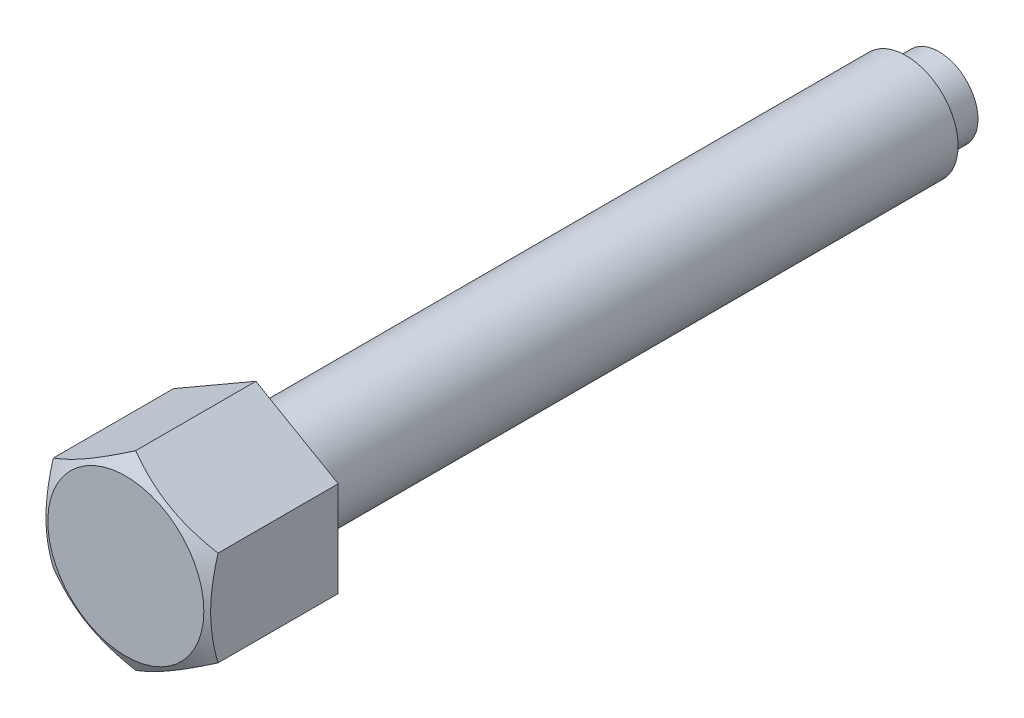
ISO-10303-21;
HEADER;
FILE_DESCRIPTION(('STEP AP214'),'2;1');
FILE_NAME('part.step','',(''),(''),'','','');
FILE_SCHEMA(('AUTOMOTIVE_DESIGN { 1 0 10303 214 1 1 1 1 }'));
ENDSEC;
DATA;
#1=APPLICATION_CONTEXT('core data for automotive mechanical design processes');
#2=APPLICATION_PROTOCOL_DEFINITION('international standard','automotive_design',2000,#1);
#3=PRODUCT_CONTEXT('',#1,'mechanical');
#4=PRODUCT('Part','Part','',(#3));
#5=PRODUCT_RELATED_PRODUCT_CATEGORY('part','',(#4));
#6=PRODUCT_DEFINITION_FORMATION('','',#4);
#7=PRODUCT_DEFINITION_CONTEXT('part definition',#1,'design');
#8=PRODUCT_DEFINITION('design','',#6,#7);
#9=PRODUCT_DEFINITION_SHAPE('','',#8);
#10=(LENGTH_UNIT() NAMED_UNIT(*) SI_UNIT(.MILLI.,.METRE.));
#11=(NAMED_UNIT(*) PLANE_ANGLE_UNIT() SI_UNIT($,.RADIAN.));
#12=(NAMED_UNIT(*) SI_UNIT($,.STERADIAN.) SOLID_ANGLE_UNIT());
#13=UNCERTAINTY_MEASURE_WITH_UNIT(LENGTH_MEASURE(1.E-05),#10,'distance_accuracy_value','');
#14=(GEOMETRIC_REPRESENTATION_CONTEXT(3) GLOBAL_UNCERTAINTY_ASSIGNED_CONTEXT((#13)) GLOBAL_UNIT_ASSIGNED_CONTEXT((#10,
#11,#12)) REPRESENTATION_CONTEXT('',''));
#15=CARTESIAN_POINT('',(0.,0.,0.));
#16=DIRECTION('',(0.,0.,1.));
#17=DIRECTION('',(1.,0.,0.));
#18=AXIS2_PLACEMENT_3D('',#15,#16,#17);
#19=CARTESIAN_POINT('',(0.,10.9696551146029,80.));
#20=DIRECTION('',(-0.5,-0.86602540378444,0.));
#21=DIRECTION('',(0.86602540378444,-0.5,0.));
#22=AXIS2_PLACEMENT_3D('',#19,#20,#21);
#23=PLANE('',#22);
#24=CARTESIAN_POINT('',(9.5002,5.4847120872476,93.862752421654));
#25=CARTESIAN_POINT('',(9.29136922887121,5.60528058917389,93.9323514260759));
#26=CARTESIAN_POINT('',(9.0817598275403,5.72629863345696,93.9987915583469));
#27=CARTESIAN_POINT('',(8.66086011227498,5.96930519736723,94.1244775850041));
#28=CARTESIAN_POINT('',(8.44956926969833,6.09129402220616,94.1837211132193));
#29=CARTESIAN_POINT('',(7.81229220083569,6.45922610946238,94.3495102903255));
#30=CARTESIAN_POINT('',(7.38379023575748,6.70662183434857,94.4438104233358));
#31=CARTESIAN_POINT('',(6.74255666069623,7.07683821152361,94.5543861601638));
#32=CARTESIAN_POINT('',(6.53174078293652,7.19855281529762,94.5858850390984));
#33=CARTESIAN_POINT('',(6.10913296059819,7.4425455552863,94.6387066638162));
#34=CARTESIAN_POINT('',(5.89734099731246,7.56482370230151,94.6600292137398));
#35=CARTESIAN_POINT('',(5.47340378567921,7.80958396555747,94.6919518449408));
#36=CARTESIAN_POINT('',(5.26125925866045,7.93206566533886,94.7025646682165));
#37=CARTESIAN_POINT('',(4.83677424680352,8.17714220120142,94.7128423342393));
#38=CARTESIAN_POINT('',(4.62443376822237,8.2997370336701,94.7125075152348));
#39=CARTESIAN_POINT('',(4.22745800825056,8.52893109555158,94.7016514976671));
#40=CARTESIAN_POINT('',(4.04279470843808,8.63554650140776,94.6924545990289));
#41=CARTESIAN_POINT('',(3.67389999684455,8.84852796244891,94.6659594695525));
#42=CARTESIAN_POINT('',(3.48966861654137,8.95489399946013,94.6486606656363));
#43=CARTESIAN_POINT('',(2.93768832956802,9.27357996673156,94.5850203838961));
#44=CARTESIAN_POINT('',(2.57091646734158,9.48533580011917,94.5269429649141));
#45=CARTESIAN_POINT('',(1.83348217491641,9.9110936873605,94.3817488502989));
#46=CARTESIAN_POINT('',(1.46291385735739,10.1250414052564,94.2940166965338));
#47=CARTESIAN_POINT('',(0.727303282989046,10.5497463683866,94.0949011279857));
#48=CARTESIAN_POINT('',(0.362251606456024,10.7605090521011,93.9835644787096));
#49=CARTESIAN_POINT('',(-0.000199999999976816,10.9697705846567,93.8627524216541));
#50=B_SPLINE_CURVE_WITH_KNOTS('',3,(#24,#25,#26,#27,#28,#29,#30,#31,#32,#33,#34,#35,#36,#37,#38,
#39,#40,#41,#42,#43,#44,#45,#46,#47,#48,#49),.UNSPECIFIED.,.F.,.F.,(4,2,2,2,2,2,2,2,2,2,2,2,4),
(0.,0.752880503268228,1.50600787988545,3.0154687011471,3.75167336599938,4.48789219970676,
5.22323407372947,5.95855322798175,6.5986808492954,7.23885375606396,8.52010929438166,
9.82978009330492,11.1368800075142),.UNSPECIFIED.);
#51=CARTESIAN_POINT('',(9.5,5.48482755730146,93.8628190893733));
#52=VERTEX_POINT('',#51);
#53=CARTESIAN_POINT('',(0.,10.9696551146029,93.8628190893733));
#54=VERTEX_POINT('',#53);
#55=EDGE_CURVE('E30',#52,#54,#50,.T.);
#56=ORIENTED_EDGE('',*,*,#55,.F.);
#57=DIRECTION('',(0.,0.,1.));
#58=VECTOR('',#57,1.);
#59=CARTESIAN_POINT('',(9.5,5.48482755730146,80.));
#60=LINE('',#59,#58);
#61=CARTESIAN_POINT('',(9.5,5.48482755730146,80.));
#62=VERTEX_POINT('',#61);
#63=EDGE_CURVE('E100',#62,#52,#60,.T.);
#64=ORIENTED_EDGE('',*,*,#63,.F.);
#65=DIRECTION('',(0.86602540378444,-0.5,0.));
#66=VECTOR('',#65,1.);
#67=CARTESIAN_POINT('',(0.,10.9696551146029,80.));
#68=LINE('',#67,#66);
#69=CARTESIAN_POINT('',(0.,10.9696551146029,80.));
#70=VERTEX_POINT('',#69);
#71=EDGE_CURVE('E38',#70,#62,#68,.T.);
#72=ORIENTED_EDGE('',*,*,#71,.F.);
#73=DIRECTION('',(0.,0.,1.));
#74=VECTOR('',#73,1.);
#75=CARTESIAN_POINT('',(0.,10.9696551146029,80.));
#76=LINE('',#75,#74);
#77=EDGE_CURVE('E88',#70,#54,#76,.T.);
#78=ORIENTED_EDGE('',*,*,#77,.T.);
#79=EDGE_LOOP('',(#56,#64,#72,#78));
#80=FACE_BOUND('',#79,.T.);
#81=ADVANCED_FACE('F15',(#80),#23,.F.);
#82=CARTESIAN_POINT('',(9.5,5.48482755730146,80.));
#83=DIRECTION('',(-1.,0.,0.));
#84=DIRECTION('',(0.,0.,1.));
#85=AXIS2_PLACEMENT_3D('',#82,#83,#84);
#86=PLANE('',#85);
#87=CARTESIAN_POINT('',(9.5,-14.6594165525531,90.1107092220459));
#88=CARTESIAN_POINT('',(9.5,-14.4522624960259,90.2110748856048));
#89=CARTESIAN_POINT('',(9.5,-14.2448633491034,90.3109344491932));
#90=CARTESIAN_POINT('',(9.5,-13.8295237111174,90.509526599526));
#91=CARTESIAN_POINT('',(9.5,-13.6215832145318,90.6082591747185));
#92=CARTESIAN_POINT('',(9.5,-12.9968165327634,90.9026207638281));
#93=CARTESIAN_POINT('',(9.5,-12.5791075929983,91.0963833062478));
#94=CARTESIAN_POINT('',(9.5,-11.7385609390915,91.4788042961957));
#95=CARTESIAN_POINT('',(9.5,-11.315707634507,91.6674285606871));
#96=CARTESIAN_POINT('',(9.5,-10.4666125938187,92.0368618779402));
#97=CARTESIAN_POINT('',(9.5,-10.0403710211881,92.2176713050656));
#98=CARTESIAN_POINT('',(9.5,-9.17036166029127,92.5749310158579));
#99=CARTESIAN_POINT('',(9.5,-8.72646376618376,92.7510662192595));
#100=CARTESIAN_POINT('',(9.5,-7.83344875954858,93.0898274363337));
#101=CARTESIAN_POINT('',(9.5,-7.38433106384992,93.2524519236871));
#102=CARTESIAN_POINT('',(9.5,-6.48102104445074,93.559867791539));
#103=CARTESIAN_POINT('',(9.5,-6.02684136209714,93.7046959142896));
#104=CARTESIAN_POINT('',(9.5,-5.11198440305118,93.971825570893));
#105=CARTESIAN_POINT('',(9.5,-4.65130924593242,94.0941342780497));
#106=CARTESIAN_POINT('',(9.5,-3.72565833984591,94.3096541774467));
#107=CARTESIAN_POINT('',(9.5,-3.2607195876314,94.4030199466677));
#108=CARTESIAN_POINT('',(9.5,-2.55913709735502,94.5172811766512));
#109=CARTESIAN_POINT('',(9.5,-2.32456277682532,94.5510719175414));
#110=CARTESIAN_POINT('',(9.5,-1.85427334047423,94.6093931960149));
#111=CARTESIAN_POINT('',(9.5,-1.61855833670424,94.6339246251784));
#112=CARTESIAN_POINT('',(9.5,-1.14935050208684,94.6729346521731));
#113=CARTESIAN_POINT('',(9.5,-0.915868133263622,94.6875386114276));
#114=CARTESIAN_POINT('',(9.5,-0.448495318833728,94.7068651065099));
#115=CARTESIAN_POINT('',(9.5,-0.214604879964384,94.7115878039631));
#116=CARTESIAN_POINT('',(9.5,0.253167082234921,94.7110393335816));
#117=CARTESIAN_POINT('',(9.5,0.487048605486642,94.7057680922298));
#118=CARTESIAN_POINT('',(9.5,0.954383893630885,94.6853591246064));
#119=CARTESIAN_POINT('',(9.5,1.18783763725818,94.6702209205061));
#120=CARTESIAN_POINT('',(9.5,1.75113488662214,94.6221081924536));
#121=CARTESIAN_POINT('',(9.5,2.0805749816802,94.5843281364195));
#122=CARTESIAN_POINT('',(9.5,2.73696350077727,94.4911945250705));
#123=CARTESIAN_POINT('',(9.5,3.06391157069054,94.4358385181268));
#124=CARTESIAN_POINT('',(9.5,3.71502004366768,94.3095223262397));
#125=CARTESIAN_POINT('',(9.5,4.03917802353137,94.2385497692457));
#126=CARTESIAN_POINT('',(9.5,4.68421967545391,94.0831617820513));
#127=CARTESIAN_POINT('',(9.5,5.00510340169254,93.9987465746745));
#128=CARTESIAN_POINT('',(9.5,5.6506287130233,93.8165343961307));
#129=CARTESIAN_POINT('',(9.5,5.97519844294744,93.7184846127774));
#130=CARTESIAN_POINT('',(9.5,6.62113966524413,93.5124153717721));
#131=CARTESIAN_POINT('',(9.5,6.94251113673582,93.4043958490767));
#132=CARTESIAN_POINT('',(9.5,7.58221768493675,93.180088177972));
#133=CARTESIAN_POINT('',(9.5,7.90055376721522,93.0638028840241));
#134=CARTESIAN_POINT('',(9.5,8.53459865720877,92.8243159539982));
#135=CARTESIAN_POINT('',(9.5,8.85030749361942,92.7011143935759));
#136=CARTESIAN_POINT('',(9.5,9.58694095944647,92.4058371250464));
#137=CARTESIAN_POINT('',(9.5,10.0069382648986,92.2314516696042));
#138=CARTESIAN_POINT('',(9.5,10.8434412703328,91.8744751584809));
#139=CARTESIAN_POINT('',(9.5,11.2599467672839,91.6918836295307));
#140=CARTESIAN_POINT('',(9.5,12.090106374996,91.3201164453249));
#141=CARTESIAN_POINT('',(9.5,12.5037598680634,91.1309394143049));
#142=CARTESIAN_POINT('',(9.5,13.328597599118,90.7473104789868));
#143=CARTESIAN_POINT('',(9.5,13.7397818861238,90.5528586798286));
#144=CARTESIAN_POINT('',(9.5,14.5605148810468,90.1594495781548));
#145=CARTESIAN_POINT('',(9.5,14.9700614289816,89.9604877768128));
#146=CARTESIAN_POINT('',(9.5,15.7874089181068,89.5590119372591));
#147=CARTESIAN_POINT('',(9.5,16.1952098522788,89.3564978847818));
#148=CARTESIAN_POINT('',(9.5,17.4163078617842,88.7446092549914));
#149=CARTESIAN_POINT('',(9.5,18.2274020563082,88.3308389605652));
#150=CARTESIAN_POINT('',(9.5,19.7788938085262,87.5293269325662));
#151=CARTESIAN_POINT('',(9.5,20.5196293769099,87.1422366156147));
#152=CARTESIAN_POINT('',(9.5,21.9983497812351,86.3627815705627));
#153=CARTESIAN_POINT('',(9.5,22.7363345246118,85.9704166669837));
#154=CARTESIAN_POINT('',(9.5,24.2083887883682,85.1826049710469));
#155=CARTESIAN_POINT('',(9.5,24.9424634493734,84.7871677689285));
#156=CARTESIAN_POINT('',(9.5,26.4088493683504,83.9931281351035));
#157=CARTESIAN_POINT('',(9.5,27.141160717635,83.5945258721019));
#158=CARTESIAN_POINT('',(9.5,27.8728206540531,83.1947394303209));
#159=B_SPLINE_CURVE_WITH_KNOTS('',3,(#87,#88,#89,#90,#91,#92,#93,#94,#95,#96,#97,#98,#99,#100,
#101,#102,#103,#104,#105,#106,#107,#108,#109,#110,#111,#112,#113,#114,#115,#116,#117,#118,#119,
#120,#121,#122,#123,#124,#125,#126,#127,#128,#129,#130,#131,#132,#133,#134,#135,#136,#137,#138,
#139,#140,#141,#142,#143,#144,#145,#146,#147,#148,#149,#150,#151,#152,#153,#154,#155,#156,#157,
#158),.UNSPECIFIED.,.F.,.F.,(4,2,2,2,2,2,2,2,2,2,2,2,2,2,2,2,2,2,2,2,2,2,2,2,2,2,2,2,2,2,2,2,2,
2,2,4),(0.,0.690559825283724,1.38112672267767,2.76246875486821,4.15145569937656,
5.54037603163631,6.97290247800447,8.40559053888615,9.83526912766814,11.2644915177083,
12.6859437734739,13.3967766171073,14.1075409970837,14.8091544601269,15.5107564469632,
16.212363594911,16.9140047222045,17.9082509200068,18.9026358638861,19.8978114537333,
20.8929705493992,21.9099480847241,22.9269322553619,23.9435669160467,24.9601904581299,
26.3243574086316,27.6886031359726,29.0531355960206,30.4176408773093,31.7835730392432,
33.1495106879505,35.881046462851,38.3883635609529,40.8957642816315,43.3971807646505,
45.8984647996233),.UNSPECIFIED.);
#160=CARTESIAN_POINT('',(9.5,-5.48482755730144,93.8628190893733));
#161=VERTEX_POINT('',#160);
#162=EDGE_CURVE('E147',#161,#52,#159,.T.);
#163=ORIENTED_EDGE('',*,*,#162,.F.);
#164=DIRECTION('',(0.,0.,1.));
#165=VECTOR('',#164,1.);
#166=CARTESIAN_POINT('',(9.5,-5.48482755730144,80.));
#167=LINE('',#166,#165);
#168=CARTESIAN_POINT('',(9.5,-5.48482755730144,80.));
#169=VERTEX_POINT('',#168);
#170=EDGE_CURVE('E97',#169,#161,#167,.T.);
#171=ORIENTED_EDGE('',*,*,#170,.F.);
#172=DIRECTION('',(0.,-1.,0.));
#173=VECTOR('',#172,1.);
#174=CARTESIAN_POINT('',(9.5,5.48482755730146,80.));
#175=LINE('',#174,#173);
#176=EDGE_CURVE('E162',#62,#169,#175,.T.);
#177=ORIENTED_EDGE('',*,*,#176,.F.);
#178=ORIENTED_EDGE('',*,*,#63,.T.);
#179=EDGE_LOOP('',(#163,#171,#177,#178));
#180=FACE_BOUND('',#179,.T.);
#181=ADVANCED_FACE('F126',(#180),#86,.F.);
#182=CARTESIAN_POINT('',(0.,-10.9696551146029,80.));
#183=DIRECTION('',(0.5,-0.866025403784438,0.));
#184=DIRECTION('',(0.866025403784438,0.5,0.));
#185=AXIS2_PLACEMENT_3D('',#182,#183,#184);
#186=PLANE('',#185);
#187=ORIENTED_EDGE('',*,*,#170,.T.);
#188=CARTESIAN_POINT('',(9.5002,-5.4847120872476,93.862752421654));
#189=CARTESIAN_POINT('',(9.29136922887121,-5.60528058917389,93.9323514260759));
#190=CARTESIAN_POINT('',(9.0817598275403,-5.72629863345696,93.9987915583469));
#191=CARTESIAN_POINT('',(8.66086011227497,-5.96930519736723,94.1244775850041));
#192=CARTESIAN_POINT('',(8.44956926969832,-6.09129402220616,94.1837211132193));
#193=CARTESIAN_POINT('',(7.81229220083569,-6.45922610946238,94.3495102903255));
#194=CARTESIAN_POINT('',(7.38379023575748,-6.70662183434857,94.4438104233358));
#195=CARTESIAN_POINT('',(6.74255666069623,-7.07683821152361,94.5543861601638));
#196=CARTESIAN_POINT('',(6.53174078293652,-7.19855281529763,94.5858850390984));
#197=CARTESIAN_POINT('',(6.10913296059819,-7.4425455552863,94.6387066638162));
#198=CARTESIAN_POINT('',(5.89734099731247,-7.56482370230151,94.6600292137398));
#199=CARTESIAN_POINT('',(5.47340378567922,-7.80958396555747,94.6919518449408));
#200=CARTESIAN_POINT('',(5.26125925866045,-7.93206566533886,94.7025646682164));
#201=CARTESIAN_POINT('',(4.83677424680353,-8.17714220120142,94.7128423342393));
#202=CARTESIAN_POINT('',(4.62443376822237,-8.2997370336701,94.7125075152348));
#203=CARTESIAN_POINT('',(4.22745800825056,-8.52893109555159,94.7016514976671));
#204=CARTESIAN_POINT('',(4.04279470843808,-8.63554650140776,94.6924545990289));
#205=CARTESIAN_POINT('',(3.67389999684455,-8.84852796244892,94.6659594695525));
#206=CARTESIAN_POINT('',(3.48966861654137,-8.95489399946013,94.6486606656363));
#207=CARTESIAN_POINT('',(2.93768832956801,-9.27357996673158,94.585020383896));
#208=CARTESIAN_POINT('',(2.57091646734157,-9.48533580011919,94.5269429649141));
#209=CARTESIAN_POINT('',(1.83348217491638,-9.91109368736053,94.381748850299));
#210=CARTESIAN_POINT('',(1.46291385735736,-10.1250414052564,94.2940166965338));
#211=CARTESIAN_POINT('',(0.727303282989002,-10.5497463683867,94.0949011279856));
#212=CARTESIAN_POINT('',(0.362251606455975,-10.7605090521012,93.9835644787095));
#213=CARTESIAN_POINT('',(-0.000200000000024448,-10.9697705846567,93.862752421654));
#214=B_SPLINE_CURVE_WITH_KNOTS('',3,(#188,#189,#190,#191,#192,#193,#194,#195,#196,#197,#198,
#199,#200,#201,#202,#203,#204,#205,#206,#207,#208,#209,#210,#211,#212,#213),.UNSPECIFIED.,.F.,
.F.,(4,2,2,2,2,2,2,2,2,2,2,2,4),(0.,0.752880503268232,1.50600787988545,3.01546870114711,
3.75167336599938,4.48789219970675,5.22323407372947,5.95855322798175,6.5986808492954,
7.23885375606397,8.52010929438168,9.82978009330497,11.1368800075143),.UNSPECIFIED.);
#215=CARTESIAN_POINT('',(0.,-10.9696551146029,93.8628190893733));
#216=VERTEX_POINT('',#215);
#217=EDGE_CURVE('E173',#161,#216,#214,.T.);
#218=ORIENTED_EDGE('',*,*,#217,.T.);
#219=DIRECTION('',(0.,0.,1.));
#220=VECTOR('',#219,1.);
#221=CARTESIAN_POINT('',(0.,-10.9696551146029,80.));
#222=LINE('',#221,#220);
#223=CARTESIAN_POINT('',(0.,-10.9696551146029,80.));
#224=VERTEX_POINT('',#223);
#225=EDGE_CURVE('E90',#224,#216,#222,.T.);
#226=ORIENTED_EDGE('',*,*,#225,.F.);
#227=DIRECTION('',(0.866025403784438,0.5,0.));
#228=VECTOR('',#227,1.);
#229=CARTESIAN_POINT('',(0.,-10.9696551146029,80.));
#230=LINE('',#229,#228);
#231=EDGE_CURVE('E159',#224,#169,#230,.T.);
#232=ORIENTED_EDGE('',*,*,#231,.T.);
#233=EDGE_LOOP('',(#187,#218,#226,#232));
#234=FACE_BOUND('',#233,.T.);
#235=ADVANCED_FACE('F131',(#234),#186,.T.);
#236=CARTESIAN_POINT('',(0.,-10.9696551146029,80.));
#237=DIRECTION('',(0.5,0.866025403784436,0.));
#238=DIRECTION('',(-0.866025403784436,0.5,0.));
#239=AXIS2_PLACEMENT_3D('',#236,#237,#238);
#240=PLANE('',#239);
#241=CARTESIAN_POINT('',(-9.5002,-5.48471208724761,93.862752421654));
#242=CARTESIAN_POINT('',(-9.29136922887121,-5.6052805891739,93.9323514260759));
#243=CARTESIAN_POINT('',(-9.0817598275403,-5.72629863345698,93.9987915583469));
#244=CARTESIAN_POINT('',(-8.66086011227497,-5.96930519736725,94.1244775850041));
#245=CARTESIAN_POINT('',(-8.44956926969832,-6.09129402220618,94.1837211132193));
#246=CARTESIAN_POINT('',(-7.81229220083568,-6.4592261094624,94.3495102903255));
#247=CARTESIAN_POINT('',(-7.38379023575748,-6.70662183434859,94.4438104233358));
#248=CARTESIAN_POINT('',(-6.74255666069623,-7.07683821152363,94.5543861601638));
#249=CARTESIAN_POINT('',(-6.53174078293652,-7.19855281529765,94.5858850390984));
#250=CARTESIAN_POINT('',(-6.10913296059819,-7.44254555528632,94.6387066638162));
#251=CARTESIAN_POINT('',(-5.89734099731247,-7.56482370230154,94.6600292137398));
#252=CARTESIAN_POINT('',(-5.47340378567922,-7.80958396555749,94.6919518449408));
#253=CARTESIAN_POINT('',(-5.26125925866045,-7.93206566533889,94.7025646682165));
#254=CARTESIAN_POINT('',(-4.83677424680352,-8.17714220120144,94.7128423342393));
#255=CARTESIAN_POINT('',(-4.62443376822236,-8.29973703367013,94.7125075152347));
#256=CARTESIAN_POINT('',(-4.22745800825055,-8.52893109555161,94.701651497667));
#257=CARTESIAN_POINT('',(-4.04279470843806,-8.6355465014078,94.6924545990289));
#258=CARTESIAN_POINT('',(-3.67389999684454,-8.84852796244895,94.6659594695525));
#259=CARTESIAN_POINT('',(-3.48966861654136,-8.95489399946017,94.6486606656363));
#260=CARTESIAN_POINT('',(-2.937688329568,-9.2735799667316,94.585020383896));
#261=CARTESIAN_POINT('',(-2.57091646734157,-9.48533580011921,94.5269429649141));
#262=CARTESIAN_POINT('',(-1.8334821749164,-9.91109368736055,94.3817488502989));
#263=CARTESIAN_POINT('',(-1.46291385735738,-10.1250414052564,94.2940166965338));
#264=CARTESIAN_POINT('',(-0.727303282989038,-10.5497463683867,94.0949011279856));
#265=CARTESIAN_POINT('',(-0.362251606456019,-10.7605090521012,93.9835644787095));
#266=CARTESIAN_POINT('',(0.000199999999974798,-10.9697705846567,93.862752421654));
#267=B_SPLINE_CURVE_WITH_KNOTS('',3,(#241,#242,#243,#244,#245,#246,#247,#248,#249,#250,#251,
#252,#253,#254,#255,#256,#257,#258,#259,#260,#261,#262,#263,#264,#265,#266),.UNSPECIFIED.,.F.,
.F.,(4,2,2,2,2,2,2,2,2,2,2,2,4),(0.,0.75288050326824,1.50600787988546,3.0154687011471,
3.75167336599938,4.48789219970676,5.22323407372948,5.95855322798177,6.59868084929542,
7.23885375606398,8.52010929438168,9.82978009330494,11.1368800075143),.UNSPECIFIED.);
#268=CARTESIAN_POINT('',(-9.5,-5.48482755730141,93.8628190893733));
#269=VERTEX_POINT('',#268);
#270=EDGE_CURVE('E82',#269,#216,#267,.T.);
#271=ORIENTED_EDGE('',*,*,#270,.F.);
#272=DIRECTION('',(0.,0.,1.));
#273=VECTOR('',#272,1.);
#274=CARTESIAN_POINT('',(-9.5,-5.48482755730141,80.));
#275=LINE('',#274,#273);
#276=CARTESIAN_POINT('',(-9.5,-5.48482755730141,80.));
#277=VERTEX_POINT('',#276);
#278=EDGE_CURVE('E81',#277,#269,#275,.T.);
#279=ORIENTED_EDGE('',*,*,#278,.F.);
#280=DIRECTION('',(-0.866025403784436,0.5,0.));
#281=VECTOR('',#280,1.);
#282=CARTESIAN_POINT('',(0.,-10.9696551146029,80.));
#283=LINE('',#282,#281);
#284=EDGE_CURVE('E156',#224,#277,#283,.T.);
#285=ORIENTED_EDGE('',*,*,#284,.F.);
#286=ORIENTED_EDGE('',*,*,#225,.T.);
#287=EDGE_LOOP('',(#271,#279,#285,#286));
#288=FACE_BOUND('',#287,.T.);
#289=ADVANCED_FACE('F171',(#288),#240,.F.);
#290=CARTESIAN_POINT('',(-9.5,5.48482755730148,80.));
#291=DIRECTION('',(-1.,0.,0.));
#292=DIRECTION('',(0.,0.,1.));
#293=AXIS2_PLACEMENT_3D('',#290,#291,#292);
#294=PLANE('',#293);
#295=ORIENTED_EDGE('',*,*,#278,.T.);
#296=CARTESIAN_POINT('',(-9.5,-14.6594165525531,90.1107092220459));
#297=CARTESIAN_POINT('',(-9.5,-14.4522624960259,90.2110748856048));
#298=CARTESIAN_POINT('',(-9.5,-14.2448633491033,90.3109344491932));
#299=CARTESIAN_POINT('',(-9.5,-13.8295237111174,90.509526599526));
#300=CARTESIAN_POINT('',(-9.5,-13.6215832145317,90.6082591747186));
#301=CARTESIAN_POINT('',(-9.5,-12.9968165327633,90.9026207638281));
#302=CARTESIAN_POINT('',(-9.5,-12.5791075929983,91.0963833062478));
#303=CARTESIAN_POINT('',(-9.5,-11.7385609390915,91.4788042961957));
#304=CARTESIAN_POINT('',(-9.5,-11.3157076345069,91.6674285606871));
#305=CARTESIAN_POINT('',(-9.5,-10.4666125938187,92.0368618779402));
#306=CARTESIAN_POINT('',(-9.5,-10.0403710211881,92.2176713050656));
#307=CARTESIAN_POINT('',(-9.5,-9.17036166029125,92.5749310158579));
#308=CARTESIAN_POINT('',(-9.5,-8.72646376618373,92.7510662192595));
#309=CARTESIAN_POINT('',(-9.5,-7.83344875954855,93.0898274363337));
#310=CARTESIAN_POINT('',(-9.5,-7.3843310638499,93.2524519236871));
#311=CARTESIAN_POINT('',(-9.5,-6.48102104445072,93.559867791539));
#312=CARTESIAN_POINT('',(-9.5,-6.02684136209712,93.7046959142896));
#313=CARTESIAN_POINT('',(-9.5,-5.11198440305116,93.971825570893));
#314=CARTESIAN_POINT('',(-9.5,-4.6513092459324,94.0941342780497));
#315=CARTESIAN_POINT('',(-9.5,-3.72565833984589,94.3096541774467));
#316=CARTESIAN_POINT('',(-9.5,-3.26071958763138,94.4030199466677));
#317=CARTESIAN_POINT('',(-9.5,-2.559137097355,94.5172811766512));
#318=CARTESIAN_POINT('',(-9.5,-2.3245627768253,94.5510719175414));
#319=CARTESIAN_POINT('',(-9.5,-1.85427334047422,94.6093931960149));
#320=CARTESIAN_POINT('',(-9.5,-1.61855833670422,94.6339246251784));
#321=CARTESIAN_POINT('',(-9.5,-1.14935050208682,94.6729346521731));
#322=CARTESIAN_POINT('',(-9.5,-0.915868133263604,94.6875386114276));
#323=CARTESIAN_POINT('',(-9.5,-0.44849531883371,94.7068651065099));
#324=CARTESIAN_POINT('',(-9.5,-0.214604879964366,94.7115878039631));
#325=CARTESIAN_POINT('',(-9.5,0.25316708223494,94.7110393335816));
#326=CARTESIAN_POINT('',(-9.5,0.48704860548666,94.7057680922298));
#327=CARTESIAN_POINT('',(-9.5,0.954383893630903,94.6853591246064));
#328=CARTESIAN_POINT('',(-9.5,1.1878376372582,94.6702209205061));
#329=CARTESIAN_POINT('',(-9.5,1.75113488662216,94.6221081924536));
#330=CARTESIAN_POINT('',(-9.5,2.08057498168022,94.5843281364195));
#331=CARTESIAN_POINT('',(-9.5,2.73696350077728,94.4911945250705));
#332=CARTESIAN_POINT('',(-9.5,3.06391157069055,94.4358385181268));
#333=CARTESIAN_POINT('',(-9.5,3.7150200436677,94.3095223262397));
#334=CARTESIAN_POINT('',(-9.5,4.03917802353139,94.2385497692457));
#335=CARTESIAN_POINT('',(-9.5,4.68421967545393,94.0831617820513));
#336=CARTESIAN_POINT('',(-9.5,5.00510340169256,93.9987465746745));
#337=CARTESIAN_POINT('',(-9.5,5.65062871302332,93.8165343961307));
#338=CARTESIAN_POINT('',(-9.5,5.97519844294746,93.7184846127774));
#339=CARTESIAN_POINT('',(-9.5,6.62113966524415,93.5124153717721));
#340=CARTESIAN_POINT('',(-9.5,6.94251113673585,93.4043958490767));
#341=CARTESIAN_POINT('',(-9.5,7.58221768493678,93.180088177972));
#342=CARTESIAN_POINT('',(-9.5,7.90055376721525,93.0638028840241));
#343=CARTESIAN_POINT('',(-9.5,8.5345986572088,92.8243159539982));
#344=CARTESIAN_POINT('',(-9.5,8.85030749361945,92.7011143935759));
#345=CARTESIAN_POINT('',(-9.5,9.5869409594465,92.4058371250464));
#346=CARTESIAN_POINT('',(-9.5,10.0069382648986,92.2314516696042));
#347=CARTESIAN_POINT('',(-9.5,10.8434412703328,91.8744751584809));
#348=CARTESIAN_POINT('',(-9.5,11.2599467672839,91.6918836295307));
#349=CARTESIAN_POINT('',(-9.5,12.0901063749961,91.3201164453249));
#350=CARTESIAN_POINT('',(-9.5,12.5037598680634,91.1309394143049));
#351=CARTESIAN_POINT('',(-9.5,13.328597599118,90.7473104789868));
#352=CARTESIAN_POINT('',(-9.5,13.7397818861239,90.5528586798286));
#353=CARTESIAN_POINT('',(-9.5,14.5605148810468,90.1594495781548));
#354=CARTESIAN_POINT('',(-9.5,14.9700614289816,89.9604877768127));
#355=CARTESIAN_POINT('',(-9.5,15.7874089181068,89.5590119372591));
#356=CARTESIAN_POINT('',(-9.5,16.1952098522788,89.3564978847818));
#357=CARTESIAN_POINT('',(-9.5,17.4163078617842,88.7446092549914));
#358=CARTESIAN_POINT('',(-9.5,18.2274020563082,88.3308389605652));
#359=CARTESIAN_POINT('',(-9.5,19.7788938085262,87.5293269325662));
#360=CARTESIAN_POINT('',(-9.5,20.5196293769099,87.1422366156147));
#361=CARTESIAN_POINT('',(-9.5,21.9983497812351,86.3627815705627));
#362=CARTESIAN_POINT('',(-9.5,22.7363345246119,85.9704166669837));
#363=CARTESIAN_POINT('',(-9.5,24.2083887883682,85.1826049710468));
#364=CARTESIAN_POINT('',(-9.5,24.9424634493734,84.7871677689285));
#365=CARTESIAN_POINT('',(-9.5,26.4088493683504,83.9931281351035));
#366=CARTESIAN_POINT('',(-9.5,27.141160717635,83.5945258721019));
#367=CARTESIAN_POINT('',(-9.5,27.8728206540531,83.1947394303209));
#368=B_SPLINE_CURVE_WITH_KNOTS('',3,(#296,#297,#298,#299,#300,#301,#302,#303,#304,#305,#306,
#307,#308,#309,#310,#311,#312,#313,#314,#315,#316,#317,#318,#319,#320,#321,#322,#323,#324,#325,
#326,#327,#328,#329,#330,#331,#332,#333,#334,#335,#336,#337,#338,#339,#340,#341,#342,#343,#344,
#345,#346,#347,#348,#349,#350,#351,#352,#353,#354,#355,#356,#357,#358,#359,#360,#361,#362,#363,
#364,#365,#366,#367),.UNSPECIFIED.,.F.,.F.,(4,2,2,2,2,2,2,2,2,2,2,2,2,2,2,2,2,2,2,2,2,2,2,2,2,2,
2,2,2,2,2,2,2,2,2,4),(0.,0.690559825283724,1.38112672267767,2.7624687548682,4.15145569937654,
5.54037603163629,6.97290247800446,8.40559053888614,9.83526912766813,11.2644915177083,
12.6859437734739,13.3967766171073,14.1075409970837,14.8091544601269,15.5107564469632,
16.212363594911,16.9140047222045,17.9082509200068,18.9026358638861,19.8978114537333,
20.8929705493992,21.9099480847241,22.9269322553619,23.9435669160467,24.9601904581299,
26.3243574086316,27.6886031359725,29.0531355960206,30.4176408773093,31.7835730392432,
33.1495106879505,35.881046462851,38.3883635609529,40.8957642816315,43.3971807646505,
45.8984647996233),.UNSPECIFIED.);
#369=CARTESIAN_POINT('',(-9.5,5.48482755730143,93.8628190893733));
#370=VERTEX_POINT('',#369);
#371=EDGE_CURVE('E69',#269,#370,#368,.T.);
#372=ORIENTED_EDGE('',*,*,#371,.T.);
#373=DIRECTION('',(0.,0.,1.));
#374=VECTOR('',#373,1.);
#375=CARTESIAN_POINT('',(-9.5,5.48482755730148,80.));
#376=LINE('',#375,#374);
#377=CARTESIAN_POINT('',(-9.5,5.48482755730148,80.));
#378=VERTEX_POINT('',#377);
#379=EDGE_CURVE('E79',#378,#370,#376,.T.);
#380=ORIENTED_EDGE('',*,*,#379,.F.);
#381=DIRECTION('',(0.,-1.,0.));
#382=VECTOR('',#381,1.);
#383=CARTESIAN_POINT('',(-9.5,5.48482755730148,80.));
#384=LINE('',#383,#382);
#385=EDGE_CURVE('E154',#378,#277,#384,.T.);
#386=ORIENTED_EDGE('',*,*,#385,.T.);
#387=EDGE_LOOP('',(#295,#372,#380,#386));
#388=FACE_BOUND('',#387,.T.);
#389=ADVANCED_FACE('F77',(#388),#294,.T.);
#390=CARTESIAN_POINT('',(0.,10.9696551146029,80.));
#391=DIRECTION('',(-0.5,0.866025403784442,0.));
#392=DIRECTION('',(-0.866025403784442,-0.5,0.));
#393=AXIS2_PLACEMENT_3D('',#390,#391,#392);
#394=PLANE('',#393);
#395=ORIENTED_EDGE('',*,*,#379,.T.);
#396=CARTESIAN_POINT('',(-9.5002,5.48471208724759,93.862752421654));
#397=CARTESIAN_POINT('',(-9.29136922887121,5.60528058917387,93.9323514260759));
#398=CARTESIAN_POINT('',(-9.0817598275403,5.72629863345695,93.9987915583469));
#399=CARTESIAN_POINT('',(-8.66086011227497,5.96930519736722,94.1244775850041));
#400=CARTESIAN_POINT('',(-8.44956926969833,6.09129402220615,94.1837211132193));
#401=CARTESIAN_POINT('',(-7.81229220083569,6.45922610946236,94.3495102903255));
#402=CARTESIAN_POINT('',(-7.38379023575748,6.70662183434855,94.4438104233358));
#403=CARTESIAN_POINT('',(-6.74255666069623,7.07683821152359,94.5543861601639));
#404=CARTESIAN_POINT('',(-6.53174078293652,7.1985528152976,94.5858850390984));
#405=CARTESIAN_POINT('',(-6.10913296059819,7.44254555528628,94.6387066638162));
#406=CARTESIAN_POINT('',(-5.89734099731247,7.56482370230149,94.6600292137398));
#407=CARTESIAN_POINT('',(-5.47340378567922,7.80958396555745,94.6919518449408));
#408=CARTESIAN_POINT('',(-5.26125925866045,7.93206566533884,94.7025646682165));
#409=CARTESIAN_POINT('',(-4.83677424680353,8.17714220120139,94.7128423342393));
#410=CARTESIAN_POINT('',(-4.62443376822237,8.29973703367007,94.7125075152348));
#411=CARTESIAN_POINT('',(-4.22745800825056,8.52893109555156,94.7016514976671));
#412=CARTESIAN_POINT('',(-4.04279470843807,8.63554650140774,94.6924545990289));
#413=CARTESIAN_POINT('',(-3.67389999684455,8.84852796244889,94.6659594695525));
#414=CARTESIAN_POINT('',(-3.48966861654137,8.95489399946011,94.6486606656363));
#415=CARTESIAN_POINT('',(-2.937688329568,9.27357996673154,94.585020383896));
#416=CARTESIAN_POINT('',(-2.57091646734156,9.48533580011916,94.5269429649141));
#417=CARTESIAN_POINT('',(-1.83348217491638,9.91109368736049,94.381748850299));
#418=CARTESIAN_POINT('',(-1.46291385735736,10.1250414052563,94.2940166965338));
#419=CARTESIAN_POINT('',(-0.727303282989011,10.5497463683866,94.0949011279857));
#420=CARTESIAN_POINT('',(-0.362251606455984,10.7605090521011,93.9835644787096));
#421=CARTESIAN_POINT('',(0.000200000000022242,10.9697705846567,93.8627524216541));
#422=B_SPLINE_CURVE_WITH_KNOTS('',3,(#396,#397,#398,#399,#400,#401,#402,#403,#404,#405,#406,
#407,#408,#409,#410,#411,#412,#413,#414,#415,#416,#417,#418,#419,#420,#421),.UNSPECIFIED.,.F.,
.F.,(4,2,2,2,2,2,2,2,2,2,2,2,4),(0.,0.752880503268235,1.50600787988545,3.0154687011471,
3.75167336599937,4.48789219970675,5.22323407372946,5.95855322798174,6.5986808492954,
7.23885375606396,8.52010929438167,9.82978009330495,11.1368800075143),.UNSPECIFIED.);
#423=EDGE_CURVE('E66',#370,#54,#422,.T.);
#424=ORIENTED_EDGE('',*,*,#423,.T.);
#425=ORIENTED_EDGE('',*,*,#77,.F.);
#426=DIRECTION('',(-0.866025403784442,-0.5,0.));
#427=VECTOR('',#426,1.);
#428=CARTESIAN_POINT('',(0.,10.9696551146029,80.));
#429=LINE('',#428,#427);
#430=EDGE_CURVE('E86',#70,#378,#429,.T.);
#431=ORIENTED_EDGE('',*,*,#430,.T.);
#432=EDGE_LOOP('',(#395,#424,#425,#431));
#433=FACE_BOUND('',#432,.T.);
#434=ADVANCED_FACE('F84',(#433),#394,.T.);
#435=CARTESIAN_POINT('',(0.,0.,9.));
#436=DIRECTION('',(0.,0.,1.));
#437=DIRECTION('',(1.,0.,0.));
#438=AXIS2_PLACEMENT_3D('',#435,#436,#437);
#439=SPHERICAL_SURFACE('',#438,9.);
#440=CARTESIAN_POINT('',(0.,0.,1.20577136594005));
#441=DIRECTION('',(0.,0.,1.));
#442=DIRECTION('',(1.,0.,0.));
#443=AXIS2_PLACEMENT_3D('',#440,#441,#442);
#444=CIRCLE('',#443,4.5);
#445=CARTESIAN_POINT('',(4.5,0.,1.20577136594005));
#446=VERTEX_POINT('',#445);
#447=EDGE_CURVE('E9',#446,#446,#444,.T.);
#448=ORIENTED_EDGE('',*,*,#447,.F.);
#449=EDGE_LOOP('',(#448));
#450=FACE_BOUND('',#449,.T.);
#451=ADVANCED_FACE('F17',(#450),#439,.T.);
#452=CARTESIAN_POINT('',(0.,0.,110.));
#453=DIRECTION('',(0.,0.,1.));
#454=DIRECTION('',(1.,0.,0.));
#455=AXIS2_PLACEMENT_3D('',#452,#453,#454);
#456=CYLINDRICAL_SURFACE('',#455,4.5);
#457=ORIENTED_EDGE('',*,*,#447,.T.);
#458=EDGE_LOOP('',(#457));
#459=FACE_BOUND('',#458,.T.);
#460=CARTESIAN_POINT('',(0.,0.,5.));
#461=DIRECTION('',(0.,0.,1.));
#462=DIRECTION('',(1.,0.,0.));
#463=AXIS2_PLACEMENT_3D('',#460,#461,#462);
#464=CIRCLE('',#463,4.5);
#465=CARTESIAN_POINT('',(4.5,0.,5.));
#466=VERTEX_POINT('',#465);
#467=EDGE_CURVE('E23',#466,#466,#464,.T.);
#468=ORIENTED_EDGE('',*,*,#467,.F.);
#469=EDGE_LOOP('',(#468));
#470=FACE_BOUND('',#469,.T.);
#471=ADVANCED_FACE('F113',(#459,#470),#456,.T.);
#472=CARTESIAN_POINT('',(4.5,0.,5.));
#473=DIRECTION('',(0.,0.,1.));
#474=DIRECTION('',(1.,0.,0.));
#475=AXIS2_PLACEMENT_3D('',#472,#473,#474);
#476=PLANE('',#475);
#477=CARTESIAN_POINT('',(0.,0.,5.));
#478=DIRECTION('',(0.,0.,1.));
#479=DIRECTION('',(1.,0.,0.));
#480=AXIS2_PLACEMENT_3D('',#477,#478,#479);
#481=CIRCLE('',#480,6.);
#482=CARTESIAN_POINT('',(6.,0.,5.));
#483=VERTEX_POINT('',#482);
#484=EDGE_CURVE('E106',#483,#483,#481,.T.);
#485=ORIENTED_EDGE('',*,*,#484,.F.);
#486=EDGE_LOOP('',(#485));
#487=FACE_BOUND('',#486,.T.);
#488=ORIENTED_EDGE('',*,*,#467,.T.);
#489=EDGE_LOOP('',(#488));
#490=FACE_BOUND('',#489,.T.);
#491=ADVANCED_FACE('F111',(#487,#490),#476,.F.);
#492=CARTESIAN_POINT('',(0.,0.,110.));
#493=DIRECTION('',(0.,0.,1.));
#494=DIRECTION('',(1.,0.,0.));
#495=AXIS2_PLACEMENT_3D('',#492,#493,#494);
#496=CYLINDRICAL_SURFACE('',#495,6.);
#497=CARTESIAN_POINT('',(0.,0.,80.));
#498=DIRECTION('',(0.,0.,1.));
#499=DIRECTION('',(1.,0.,0.));
#500=AXIS2_PLACEMENT_3D('',#497,#498,#499);
#501=CIRCLE('',#500,6.);
#502=CARTESIAN_POINT('',(6.,0.,80.));
#503=VERTEX_POINT('',#502);
#504=EDGE_CURVE('E103',#503,#503,#501,.T.);
#505=ORIENTED_EDGE('',*,*,#504,.F.);
#506=EDGE_LOOP('',(#505));
#507=FACE_BOUND('',#506,.T.);
#508=ORIENTED_EDGE('',*,*,#484,.T.);
#509=EDGE_LOOP('',(#508));
#510=FACE_BOUND('',#509,.T.);
#511=ADVANCED_FACE('F121',(#507,#510),#496,.T.);
#512=CARTESIAN_POINT('',(6.,0.,80.));
#513=DIRECTION('',(0.,0.,1.));
#514=DIRECTION('',(1.,0.,0.));
#515=AXIS2_PLACEMENT_3D('',#512,#513,#514);
#516=PLANE('',#515);
#517=ORIENTED_EDGE('',*,*,#430,.F.);
#518=ORIENTED_EDGE('',*,*,#71,.T.);
#519=ORIENTED_EDGE('',*,*,#176,.T.);
#520=ORIENTED_EDGE('',*,*,#231,.F.);
#521=ORIENTED_EDGE('',*,*,#284,.T.);
#522=ORIENTED_EDGE('',*,*,#385,.F.);
#523=EDGE_LOOP('',(#517,#518,#519,#520,#521,#522));
#524=FACE_BOUND('',#523,.T.);
#525=ORIENTED_EDGE('',*,*,#504,.T.);
#526=EDGE_LOOP('',(#525));
#527=FACE_BOUND('',#526,.T.);
#528=ADVANCED_FACE('F165',(#524,#527),#516,.F.);
#529=CARTESIAN_POINT('',(0.,0.,95.));
#530=DIRECTION('',(0.,0.,-1.));
#531=DIRECTION('',(-1.,0.,0.));
#532=AXIS2_PLACEMENT_3D('',#529,#530,#531);
#533=CONICAL_SURFACE('',#532,9.,1.0471975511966);
#534=CARTESIAN_POINT('',(0.,0.,95.));
#535=DIRECTION('',(0.,0.,1.));
#536=DIRECTION('',(1.,0.,0.));
#537=AXIS2_PLACEMENT_3D('',#534,#535,#536);
#538=CIRCLE('',#537,9.);
#539=CARTESIAN_POINT('',(9.,0.,95.));
#540=VERTEX_POINT('',#539);
#541=EDGE_CURVE('E73',#540,#540,#538,.T.);
#542=ORIENTED_EDGE('',*,*,#541,.F.);
#543=EDGE_LOOP('',(#542));
#544=FACE_BOUND('',#543,.T.);
#545=ORIENTED_EDGE('',*,*,#55,.T.);
#546=ORIENTED_EDGE('',*,*,#423,.F.);
#547=ORIENTED_EDGE('',*,*,#371,.F.);
#548=ORIENTED_EDGE('',*,*,#270,.T.);
#549=ORIENTED_EDGE('',*,*,#217,.F.);
#550=ORIENTED_EDGE('',*,*,#162,.T.);
#551=EDGE_LOOP('',(#545,#546,#547,#548,#549,#550));
#552=FACE_BOUND('',#551,.T.);
#553=ADVANCED_FACE('F68',(#544,#552),#533,.T.);
#554=CARTESIAN_POINT('',(0.,0.,95.));
#555=DIRECTION('',(0.,0.,1.));
#556=DIRECTION('',(1.,0.,0.));
#557=AXIS2_PLACEMENT_3D('',#554,#555,#556);
#558=PLANE('',#557);
#559=ORIENTED_EDGE('',*,*,#541,.T.);
#560=EDGE_LOOP('',(#559));
#561=FACE_BOUND('',#560,.T.);
#562=ADVANCED_FACE('F197',(#561),#558,.T.);
#563=CLOSED_SHELL('',(#81,#181,#235,#289,#389,#434,#451,#471,#491,#511,#528,#553,#562));
#564=MANIFOLD_SOLID_BREP('B1',#563);
#565=ADVANCED_BREP_SHAPE_REPRESENTATION('',(#18,#564),#14);
#566=SHAPE_DEFINITION_REPRESENTATION(#9,#565);
ENDSEC;
END-ISO-10303-21;
